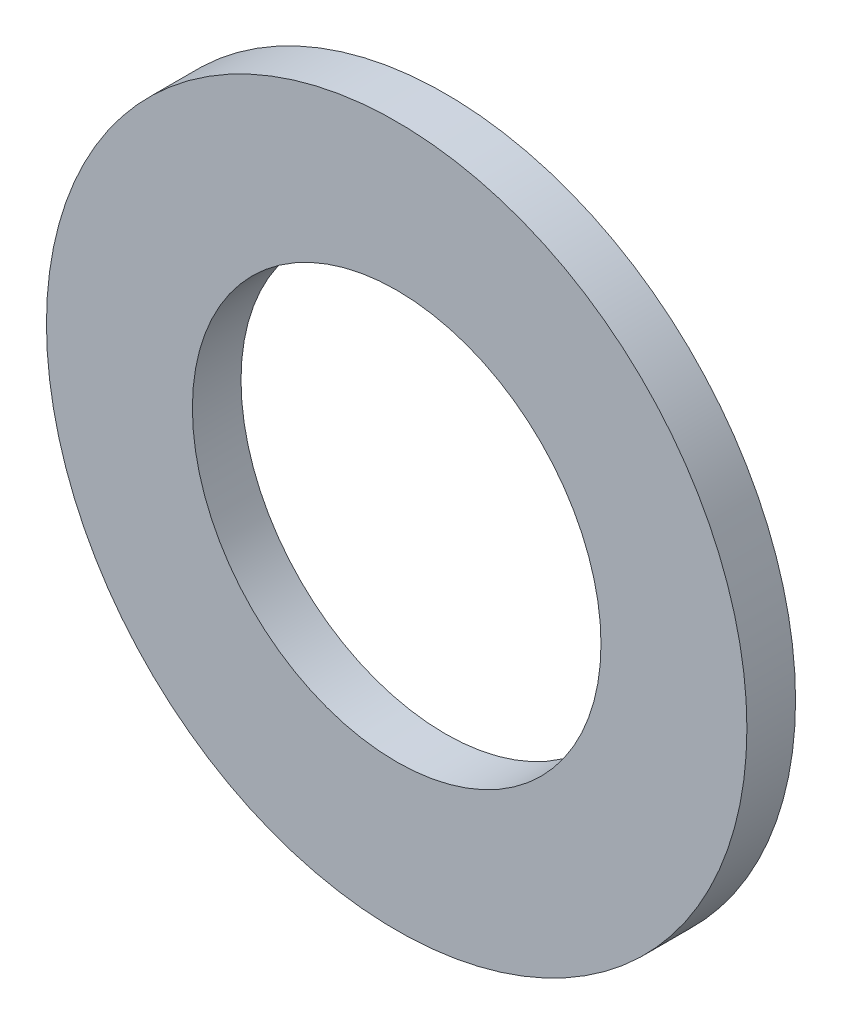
ISO-10303-21;
HEADER;
FILE_DESCRIPTION(('STEP AP214'),'2;1');
FILE_NAME('part.step','',(''),(''),'','','');
FILE_SCHEMA(('AUTOMOTIVE_DESIGN { 1 0 10303 214 1 1 1 1 }'));
ENDSEC;
DATA;
#1=APPLICATION_CONTEXT('core data for automotive mechanical design processes');
#2=APPLICATION_PROTOCOL_DEFINITION('international standard','automotive_design',2000,#1);
#3=PRODUCT_CONTEXT('',#1,'mechanical');
#4=PRODUCT('Part','Part','',(#3));
#5=PRODUCT_RELATED_PRODUCT_CATEGORY('part','',(#4));
#6=PRODUCT_DEFINITION_FORMATION('','',#4);
#7=PRODUCT_DEFINITION_CONTEXT('part definition',#1,'design');
#8=PRODUCT_DEFINITION('design','',#6,#7);
#9=PRODUCT_DEFINITION_SHAPE('','',#8);
#10=(LENGTH_UNIT() NAMED_UNIT(*) SI_UNIT(.MILLI.,.METRE.));
#11=(NAMED_UNIT(*) PLANE_ANGLE_UNIT() SI_UNIT($,.RADIAN.));
#12=(NAMED_UNIT(*) SI_UNIT($,.STERADIAN.) SOLID_ANGLE_UNIT());
#13=UNCERTAINTY_MEASURE_WITH_UNIT(LENGTH_MEASURE(1.E-05),#10,'distance_accuracy_value','');
#14=(GEOMETRIC_REPRESENTATION_CONTEXT(3) GLOBAL_UNCERTAINTY_ASSIGNED_CONTEXT((#13)) GLOBAL_UNIT_ASSIGNED_CONTEXT((#10,
#11,#12)) REPRESENTATION_CONTEXT('',''));
#15=CARTESIAN_POINT('',(0.,0.,0.));
#16=DIRECTION('',(0.,0.,1.));
#17=DIRECTION('',(1.,0.,0.));
#18=AXIS2_PLACEMENT_3D('',#15,#16,#17);
#19=CARTESIAN_POINT('',(0.,0.,2.5));
#20=DIRECTION('',(0.,0.,1.));
#21=DIRECTION('',(1.,0.,0.));
#22=AXIS2_PLACEMENT_3D('',#19,#20,#21);
#23=PLANE('',#22);
#24=CARTESIAN_POINT('',(0.,0.,2.5));
#25=DIRECTION('',(0.,0.,1.));
#26=DIRECTION('',(1.,0.,0.));
#27=AXIS2_PLACEMENT_3D('',#24,#25,#26);
#28=CIRCLE('',#27,18.);
#29=CARTESIAN_POINT('',(18.,0.,2.5));
#30=VERTEX_POINT('',#29);
#31=EDGE_CURVE('E10',#30,#30,#28,.T.);
#32=ORIENTED_EDGE('',*,*,#31,.T.);
#33=EDGE_LOOP('',(#32));
#34=FACE_BOUND('',#33,.T.);
#35=CARTESIAN_POINT('',(0.,0.,2.5));
#36=DIRECTION('',(0.,0.,1.));
#37=DIRECTION('',(1.,0.,0.));
#38=AXIS2_PLACEMENT_3D('',#35,#36,#37);
#39=CIRCLE('',#38,10.5);
#40=CARTESIAN_POINT('',(10.5,0.,2.5));
#41=VERTEX_POINT('',#40);
#42=EDGE_CURVE('E41',#41,#41,#39,.T.);
#43=ORIENTED_EDGE('',*,*,#42,.F.);
#44=EDGE_LOOP('',(#43));
#45=FACE_BOUND('',#44,.T.);
#46=ADVANCED_FACE('F30',(#34,#45),#23,.T.);
#47=CARTESIAN_POINT('',(0.,0.,0.));
#48=DIRECTION('',(0.,0.,1.));
#49=DIRECTION('',(1.,0.,0.));
#50=AXIS2_PLACEMENT_3D('',#47,#48,#49);
#51=PLANE('',#50);
#52=CARTESIAN_POINT('',(0.,0.,0.));
#53=DIRECTION('',(0.,0.,1.));
#54=DIRECTION('',(1.,0.,0.));
#55=AXIS2_PLACEMENT_3D('',#52,#53,#54);
#56=CIRCLE('',#55,18.);
#57=CARTESIAN_POINT('',(18.,0.,0.));
#58=VERTEX_POINT('',#57);
#59=EDGE_CURVE('E34',#58,#58,#56,.T.);
#60=ORIENTED_EDGE('',*,*,#59,.F.);
#61=EDGE_LOOP('',(#60));
#62=FACE_BOUND('',#61,.T.);
#63=CARTESIAN_POINT('',(0.,0.,0.));
#64=DIRECTION('',(0.,0.,1.));
#65=DIRECTION('',(1.,0.,0.));
#66=AXIS2_PLACEMENT_3D('',#63,#64,#65);
#67=CIRCLE('',#66,10.5);
#68=CARTESIAN_POINT('',(10.5,0.,0.));
#69=VERTEX_POINT('',#68);
#70=EDGE_CURVE('E43',#69,#69,#67,.T.);
#71=ORIENTED_EDGE('',*,*,#70,.T.);
#72=EDGE_LOOP('',(#71));
#73=FACE_BOUND('',#72,.T.);
#74=ADVANCED_FACE('F53',(#62,#73),#51,.F.);
#75=CARTESIAN_POINT('',(0.,0.,2.5));
#76=DIRECTION('',(0.,0.,-1.));
#77=DIRECTION('',(-1.,0.,0.));
#78=AXIS2_PLACEMENT_3D('',#75,#76,#77);
#79=CYLINDRICAL_SURFACE('',#78,18.);
#80=ORIENTED_EDGE('',*,*,#31,.F.);
#81=EDGE_LOOP('',(#80));
#82=FACE_BOUND('',#81,.T.);
#83=ORIENTED_EDGE('',*,*,#59,.T.);
#84=EDGE_LOOP('',(#83));
#85=FACE_BOUND('',#84,.T.);
#86=ADVANCED_FACE('F32',(#82,#85),#79,.T.);
#87=CARTESIAN_POINT('',(0.,0.,2.5));
#88=DIRECTION('',(0.,0.,-1.));
#89=DIRECTION('',(-1.,0.,0.));
#90=AXIS2_PLACEMENT_3D('',#87,#88,#89);
#91=CYLINDRICAL_SURFACE('',#90,10.5);
#92=ORIENTED_EDGE('',*,*,#42,.T.);
#93=EDGE_LOOP('',(#92));
#94=FACE_BOUND('',#93,.T.);
#95=ORIENTED_EDGE('',*,*,#70,.F.);
#96=EDGE_LOOP('',(#95));
#97=FACE_BOUND('',#96,.T.);
#98=ADVANCED_FACE('F49',(#94,#97),#91,.F.);
#99=CLOSED_SHELL('',(#46,#74,#86,#98));
#100=MANIFOLD_SOLID_BREP('B2',#99);
#101=ADVANCED_BREP_SHAPE_REPRESENTATION('',(#18,#100),#14);
#102=SHAPE_DEFINITION_REPRESENTATION(#9,#101);
ENDSEC;
END-ISO-10303-21;
